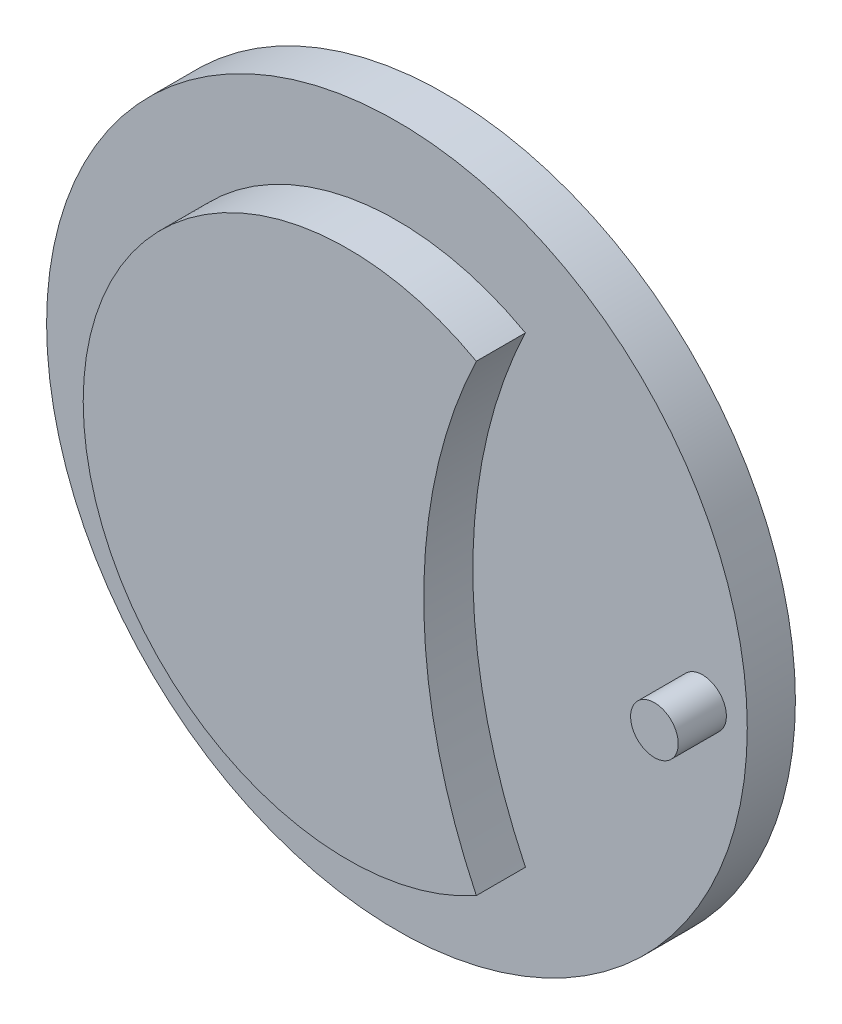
ISO-10303-21;
HEADER;
FILE_DESCRIPTION(('STEP AP214'),'2;1');
FILE_NAME('part.step','',(''),(''),'','','');
FILE_SCHEMA(('AUTOMOTIVE_DESIGN { 1 0 10303 214 1 1 1 1 }'));
ENDSEC;
DATA;
#1=APPLICATION_CONTEXT('core data for automotive mechanical design processes');
#2=APPLICATION_PROTOCOL_DEFINITION('international standard','automotive_design',2000,#1);
#3=PRODUCT_CONTEXT('',#1,'mechanical');
#4=PRODUCT('Part','Part','',(#3));
#5=PRODUCT_RELATED_PRODUCT_CATEGORY('part','',(#4));
#6=PRODUCT_DEFINITION_FORMATION('','',#4);
#7=PRODUCT_DEFINITION_CONTEXT('part definition',#1,'design');
#8=PRODUCT_DEFINITION('design','',#6,#7);
#9=PRODUCT_DEFINITION_SHAPE('','',#8);
#10=(LENGTH_UNIT() NAMED_UNIT(*) SI_UNIT(.MILLI.,.METRE.));
#11=(NAMED_UNIT(*) PLANE_ANGLE_UNIT() SI_UNIT($,.RADIAN.));
#12=(NAMED_UNIT(*) SI_UNIT($,.STERADIAN.) SOLID_ANGLE_UNIT());
#13=UNCERTAINTY_MEASURE_WITH_UNIT(LENGTH_MEASURE(1.E-05),#10,'distance_accuracy_value','');
#14=(GEOMETRIC_REPRESENTATION_CONTEXT(3) GLOBAL_UNCERTAINTY_ASSIGNED_CONTEXT((#13)) GLOBAL_UNIT_ASSIGNED_CONTEXT((#10,
#11,#12)) REPRESENTATION_CONTEXT('',''));
#15=CARTESIAN_POINT('',(0.,0.,0.));
#16=DIRECTION('',(0.,0.,1.));
#17=DIRECTION('',(1.,0.,0.));
#18=AXIS2_PLACEMENT_3D('',#15,#16,#17);
#19=CARTESIAN_POINT('',(0.,0.,0.));
#20=DIRECTION('',(0.,0.,-1.));
#21=DIRECTION('',(-1.,0.,0.));
#22=AXIS2_PLACEMENT_3D('',#19,#20,#21);
#23=PLANE('',#22);
#24=CARTESIAN_POINT('',(0.,0.,0.));
#25=DIRECTION('',(0.,0.,-1.));
#26=DIRECTION('',(-1.,0.,0.));
#27=AXIS2_PLACEMENT_3D('',#24,#25,#26);
#28=CIRCLE('',#27,69.85);
#29=CARTESIAN_POINT('',(33.9072497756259,-61.0681661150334,0.));
#30=VERTEX_POINT('',#29);
#31=CARTESIAN_POINT('',(33.9072497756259,61.0681661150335,0.));
#32=VERTEX_POINT('',#31);
#33=EDGE_CURVE('E64',#30,#32,#28,.T.);
#34=ORIENTED_EDGE('',*,*,#33,.T.);
#35=CARTESIAN_POINT('',(161.3154,0.,0.));
#36=DIRECTION('',(0.,0.,-1.));
#37=DIRECTION('',(-1.,0.,0.));
#38=AXIS2_PLACEMENT_3D('',#35,#36,#37);
#39=CIRCLE('',#38,141.2875);
#40=EDGE_CURVE('E55',#32,#30,#39,.F.);
#41=ORIENTED_EDGE('',*,*,#40,.T.);
#42=EDGE_LOOP('',(#34,#41));
#43=FACE_BOUND('',#42,.T.);
#44=CARTESIAN_POINT('',(0.,0.,0.));
#45=DIRECTION('',(0.,0.,-1.));
#46=DIRECTION('',(-1.,0.,0.));
#47=AXIS2_PLACEMENT_3D('',#44,#45,#46);
#48=CIRCLE('',#47,92.4646727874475);
#49=CARTESIAN_POINT('',(-92.4646727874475,0.,0.));
#50=VERTEX_POINT('',#49);
#51=EDGE_CURVE('E69',#50,#50,#48,.T.);
#52=ORIENTED_EDGE('',*,*,#51,.F.);
#53=EDGE_LOOP('',(#52));
#54=FACE_BOUND('',#53,.T.);
#55=CARTESIAN_POINT('',(80.655732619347,0.,0.));
#56=DIRECTION('',(0.,0.,-1.));
#57=DIRECTION('',(-1.,0.,0.));
#58=AXIS2_PLACEMENT_3D('',#55,#56,#57);
#59=CIRCLE('',#58,6.2865);
#60=CARTESIAN_POINT('',(74.369232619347,0.,0.));
#61=VERTEX_POINT('',#60);
#62=EDGE_CURVE('E11',#61,#61,#59,.F.);
#63=ORIENTED_EDGE('',*,*,#62,.F.);
#64=EDGE_LOOP('',(#63));
#65=FACE_BOUND('',#64,.T.);
#66=ADVANCED_FACE('F28',(#43,#54,#65),#23,.F.);
#67=CARTESIAN_POINT('',(0.,0.,12.954));
#68=DIRECTION('',(0.,0.,-1.));
#69=DIRECTION('',(-1.,0.,0.));
#70=AXIS2_PLACEMENT_3D('',#67,#68,#69);
#71=CYLINDRICAL_SURFACE('',#70,69.85);
#72=ORIENTED_EDGE('',*,*,#33,.F.);
#73=DIRECTION('',(0.,0.,1.));
#74=VECTOR('',#73,1.);
#75=CARTESIAN_POINT('',(33.9072497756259,-61.0681661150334,-131.907260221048));
#76=LINE('',#75,#74);
#77=CARTESIAN_POINT('',(33.9072497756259,-61.0681661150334,12.954));
#78=VERTEX_POINT('',#77);
#79=EDGE_CURVE('E52',#30,#78,#76,.T.);
#80=ORIENTED_EDGE('',*,*,#79,.T.);
#81=CARTESIAN_POINT('',(0.,0.,12.954));
#82=DIRECTION('',(0.,0.,1.));
#83=DIRECTION('',(1.,0.,0.));
#84=AXIS2_PLACEMENT_3D('',#81,#82,#83);
#85=CIRCLE('',#84,69.85);
#86=CARTESIAN_POINT('',(33.9072497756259,61.0681661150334,12.954));
#87=VERTEX_POINT('',#86);
#88=EDGE_CURVE('E36',#87,#78,#85,.T.);
#89=ORIENTED_EDGE('',*,*,#88,.F.);
#90=DIRECTION('',(0.,0.,1.));
#91=VECTOR('',#90,1.);
#92=CARTESIAN_POINT('',(33.9072497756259,61.0681661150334,-131.907260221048));
#93=LINE('',#92,#91);
#94=EDGE_CURVE('E43',#32,#87,#93,.T.);
#95=ORIENTED_EDGE('',*,*,#94,.F.);
#96=EDGE_LOOP('',(#72,#80,#89,#95));
#97=FACE_BOUND('',#96,.T.);
#98=ADVANCED_FACE('F30',(#97),#71,.T.);
#99=CARTESIAN_POINT('',(0.,0.,12.954));
#100=DIRECTION('',(0.,0.,1.));
#101=DIRECTION('',(1.,0.,0.));
#102=AXIS2_PLACEMENT_3D('',#99,#100,#101);
#103=PLANE('',#102);
#104=CARTESIAN_POINT('',(161.3154,0.,12.954));
#105=DIRECTION('',(0.,0.,1.));
#106=DIRECTION('',(1.,0.,0.));
#107=AXIS2_PLACEMENT_3D('',#104,#105,#106);
#108=CIRCLE('',#107,141.2875);
#109=EDGE_CURVE('E48',#87,#78,#108,.T.);
#110=ORIENTED_EDGE('',*,*,#109,.F.);
#111=ORIENTED_EDGE('',*,*,#88,.T.);
#112=EDGE_LOOP('',(#110,#111));
#113=FACE_BOUND('',#112,.T.);
#114=ADVANCED_FACE('F95',(#113),#103,.T.);
#115=CARTESIAN_POINT('',(0.,0.,-12.7));
#116=DIRECTION('',(0.,0.,1.));
#117=DIRECTION('',(1.,0.,0.));
#118=AXIS2_PLACEMENT_3D('',#115,#116,#117);
#119=CYLINDRICAL_SURFACE('',#118,92.4646727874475);
#120=CARTESIAN_POINT('',(0.,0.,-12.7));
#121=DIRECTION('',(0.,0.,-1.));
#122=DIRECTION('',(-1.,0.,0.));
#123=AXIS2_PLACEMENT_3D('',#120,#121,#122);
#124=CIRCLE('',#123,92.4646727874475);
#125=CARTESIAN_POINT('',(-92.4646727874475,0.,-12.7));
#126=VERTEX_POINT('',#125);
#127=EDGE_CURVE('E66',#126,#126,#124,.T.);
#128=ORIENTED_EDGE('',*,*,#127,.F.);
#129=EDGE_LOOP('',(#128));
#130=FACE_BOUND('',#129,.T.);
#131=ORIENTED_EDGE('',*,*,#51,.T.);
#132=EDGE_LOOP('',(#131));
#133=FACE_BOUND('',#132,.T.);
#134=ADVANCED_FACE('F100',(#130,#133),#119,.T.);
#135=CARTESIAN_POINT('',(0.,0.,-12.7));
#136=DIRECTION('',(0.,0.,-1.));
#137=DIRECTION('',(-1.,0.,0.));
#138=AXIS2_PLACEMENT_3D('',#135,#136,#137);
#139=PLANE('',#138);
#140=ORIENTED_EDGE('',*,*,#127,.T.);
#141=EDGE_LOOP('',(#140));
#142=FACE_BOUND('',#141,.T.);
#143=ADVANCED_FACE('F85',(#142),#139,.T.);
#144=CARTESIAN_POINT('',(80.655732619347,0.,12.7));
#145=DIRECTION('',(0.,0.,-1.));
#146=DIRECTION('',(-1.,0.,0.));
#147=AXIS2_PLACEMENT_3D('',#144,#145,#146);
#148=CYLINDRICAL_SURFACE('',#147,6.2865);
#149=CARTESIAN_POINT('',(80.655732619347,0.,12.7));
#150=DIRECTION('',(0.,0.,1.));
#151=DIRECTION('',(1.,0.,0.));
#152=AXIS2_PLACEMENT_3D('',#149,#150,#151);
#153=CIRCLE('',#152,6.2865);
#154=CARTESIAN_POINT('',(86.942232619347,0.,12.7));
#155=VERTEX_POINT('',#154);
#156=EDGE_CURVE('E74',#155,#155,#153,.T.);
#157=ORIENTED_EDGE('',*,*,#156,.F.);
#158=EDGE_LOOP('',(#157));
#159=FACE_BOUND('',#158,.T.);
#160=ORIENTED_EDGE('',*,*,#62,.T.);
#161=EDGE_LOOP('',(#160));
#162=FACE_BOUND('',#161,.T.);
#163=ADVANCED_FACE('F82',(#159,#162),#148,.T.);
#164=CARTESIAN_POINT('',(80.655732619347,0.,12.7));
#165=DIRECTION('',(0.,0.,1.));
#166=DIRECTION('',(1.,0.,0.));
#167=AXIS2_PLACEMENT_3D('',#164,#165,#166);
#168=PLANE('',#167);
#169=ORIENTED_EDGE('',*,*,#156,.T.);
#170=EDGE_LOOP('',(#169));
#171=FACE_BOUND('',#170,.T.);
#172=ADVANCED_FACE('F80',(#171),#168,.T.);
#173=CARTESIAN_POINT('',(161.3154,0.,-131.907260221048));
#174=DIRECTION('',(0.,0.,1.));
#175=DIRECTION('',(1.,0.,0.));
#176=AXIS2_PLACEMENT_3D('',#173,#174,#175);
#177=CYLINDRICAL_SURFACE('',#176,141.2875);
#178=ORIENTED_EDGE('',*,*,#94,.T.);
#179=ORIENTED_EDGE('',*,*,#109,.T.);
#180=ORIENTED_EDGE('',*,*,#79,.F.);
#181=ORIENTED_EDGE('',*,*,#40,.F.);
#182=EDGE_LOOP('',(#178,#179,#180,#181));
#183=FACE_BOUND('',#182,.T.);
#184=ADVANCED_FACE('F54',(#183),#177,.F.);
#185=CLOSED_SHELL('',(#66,#98,#114,#134,#143,#163,#172,#184));
#186=MANIFOLD_SOLID_BREP('B2',#185);
#187=ADVANCED_BREP_SHAPE_REPRESENTATION('',(#18,#186),#14);
#188=SHAPE_DEFINITION_REPRESENTATION(#9,#187);
ENDSEC;
END-ISO-10303-21;
